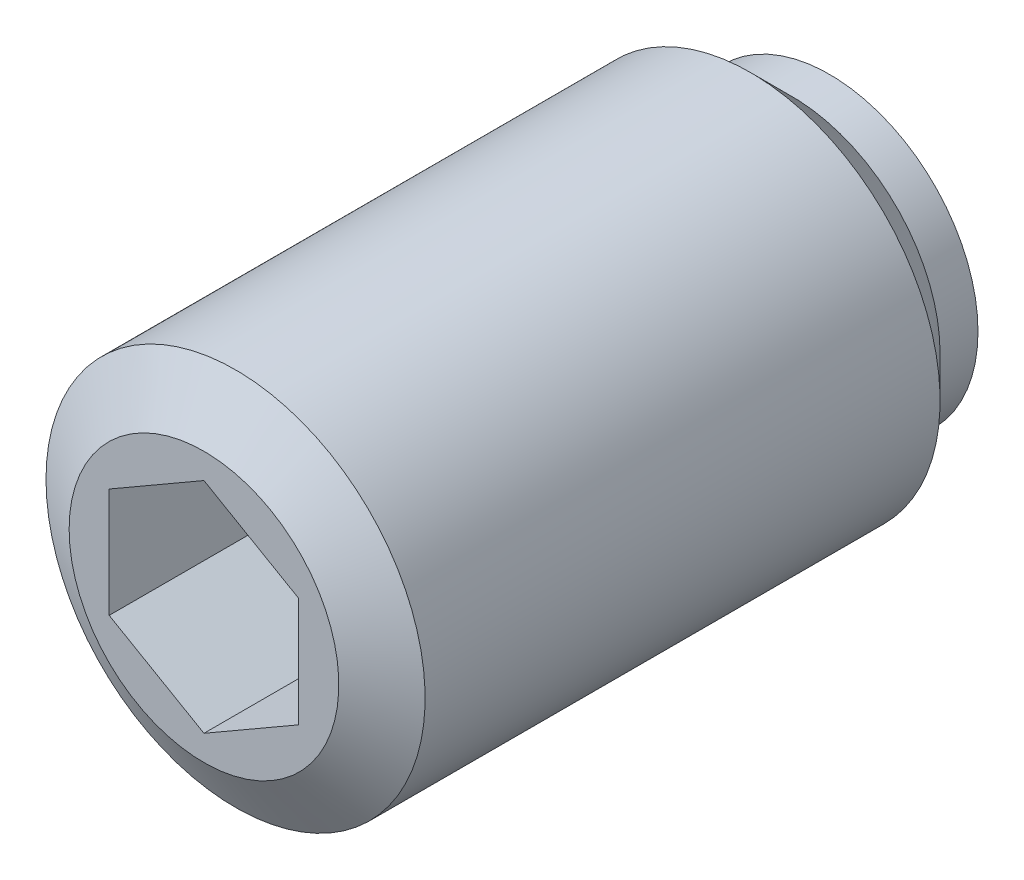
ISO-10303-21;
HEADER;
FILE_DESCRIPTION(('STEP AP214'),'2;1');
FILE_NAME('part.step','',(''),(''),'','','');
FILE_SCHEMA(('AUTOMOTIVE_DESIGN { 1 0 10303 214 1 1 1 1 }'));
ENDSEC;
DATA;
#1=APPLICATION_CONTEXT('core data for automotive mechanical design processes');
#2=APPLICATION_PROTOCOL_DEFINITION('international standard','automotive_design',2000,#1);
#3=PRODUCT_CONTEXT('',#1,'mechanical');
#4=PRODUCT('Part','Part','',(#3));
#5=PRODUCT_RELATED_PRODUCT_CATEGORY('part','',(#4));
#6=PRODUCT_DEFINITION_FORMATION('','',#4);
#7=PRODUCT_DEFINITION_CONTEXT('part definition',#1,'design');
#8=PRODUCT_DEFINITION('design','',#6,#7);
#9=PRODUCT_DEFINITION_SHAPE('','',#8);
#10=(LENGTH_UNIT() NAMED_UNIT(*) SI_UNIT(.MILLI.,.METRE.));
#11=(NAMED_UNIT(*) PLANE_ANGLE_UNIT() SI_UNIT($,.RADIAN.));
#12=(NAMED_UNIT(*) SI_UNIT($,.STERADIAN.) SOLID_ANGLE_UNIT());
#13=UNCERTAINTY_MEASURE_WITH_UNIT(LENGTH_MEASURE(1.E-05),#10,'distance_accuracy_value','');
#14=(GEOMETRIC_REPRESENTATION_CONTEXT(3) GLOBAL_UNCERTAINTY_ASSIGNED_CONTEXT((#13)) GLOBAL_UNIT_ASSIGNED_CONTEXT((#10,
#11,#12)) REPRESENTATION_CONTEXT('',''));
#15=CARTESIAN_POINT('',(0.,0.,0.));
#16=DIRECTION('',(0.,0.,1.));
#17=DIRECTION('',(1.,0.,0.));
#18=AXIS2_PLACEMENT_3D('',#15,#16,#17);
#19=CARTESIAN_POINT('',(0.,1.50253119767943,0.));
#20=DIRECTION('',(0.,0.,1.));
#21=DIRECTION('',(-1.,0.,0.));
#22=AXIS2_PLACEMENT_3D('',#19,#20,#21);
#23=PLANE('',#22);
#24=CARTESIAN_POINT('',(0.,0.,0.));
#25=DIRECTION('',(0.,0.,1.));
#26=DIRECTION('',(-1.,0.,0.));
#27=AXIS2_PLACEMENT_3D('',#24,#25,#26);
#28=CIRCLE('',#27,1.50253119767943);
#29=CARTESIAN_POINT('',(0.,1.50253119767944,0.));
#30=VERTEX_POINT('',#29);
#31=EDGE_CURVE('E9',#30,#30,#28,.T.);
#32=ORIENTED_EDGE('',*,*,#31,.F.);
#33=EDGE_LOOP('',(#32));
#34=FACE_BOUND('',#33,.T.);
#35=ADVANCED_FACE('F14',(#34),#23,.F.);
#36=CARTESIAN_POINT('',(0.,0.,1.32));
#37=DIRECTION('',(0.,0.,1.));
#38=DIRECTION('',(0.,1.,0.));
#39=AXIS2_PLACEMENT_3D('',#36,#37,#38);
#40=SPHERICAL_SURFACE('',#39,2.);
#41=CARTESIAN_POINT('',(0.,0.,0.4));
#42=DIRECTION('',(0.,0.,1.));
#43=DIRECTION('',(-1.,0.,0.));
#44=AXIS2_PLACEMENT_3D('',#41,#42,#43);
#45=CIRCLE('',#44,1.77583783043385);
#46=CARTESIAN_POINT('',(0.,1.77583783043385,0.4));
#47=VERTEX_POINT('',#46);
#48=EDGE_CURVE('E21',#47,#47,#45,.T.);
#49=CARTESIAN_POINT('',(0.,1.77583783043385,0.4));
#50=CARTESIAN_POINT('',(0.,1.77351077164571,0.395508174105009));
#51=CARTESIAN_POINT('',(0.,1.77116666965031,0.391025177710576));
#52=CARTESIAN_POINT('',(0.,1.76644451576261,0.382077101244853));
#53=CARTESIAN_POINT('',(0.,1.76406646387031,0.377612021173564));
#54=CARTESIAN_POINT('',(0.,1.75927654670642,0.368700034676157));
#55=CARTESIAN_POINT('',(0.,1.75686468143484,0.36425312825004));
#56=CARTESIAN_POINT('',(0.,1.75200727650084,0.355377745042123));
#57=CARTESIAN_POINT('',(0.,1.74956173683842,0.350949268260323));
#58=CARTESIAN_POINT('',(0.,1.74463712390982,0.342110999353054));
#59=CARTESIAN_POINT('',(0.,1.74215805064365,0.337701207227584));
#60=CARTESIAN_POINT('',(0.,1.73716651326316,0.328900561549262));
#61=CARTESIAN_POINT('',(0.,1.73465404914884,0.324509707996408));
#62=CARTESIAN_POINT('',(0.,1.72959587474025,0.315747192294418));
#63=CARTESIAN_POINT('',(0.,1.72705016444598,0.311375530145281));
#64=CARTESIAN_POINT('',(0.,1.72192564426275,0.302651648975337));
#65=CARTESIAN_POINT('',(0.,1.71934683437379,0.29829942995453));
#66=CARTESIAN_POINT('',(0.,1.71415626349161,0.289614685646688));
#67=CARTESIAN_POINT('',(0.,1.71154450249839,0.285282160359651));
#68=CARTESIAN_POINT('',(0.,1.7062881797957,0.276637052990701));
#69=CARTESIAN_POINT('',(0.,1.70364361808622,0.272324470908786));
#70=CARTESIAN_POINT('',(0.,1.69832184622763,0.263719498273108));
#71=CARTESIAN_POINT('',(0.,1.69564463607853,0.259427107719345));
#72=CARTESIAN_POINT('',(0.,1.69025772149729,0.250862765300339));
#73=CARTESIAN_POINT('',(0.,1.68754801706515,0.246590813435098));
#74=CARTESIAN_POINT('',(0.,1.68209626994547,0.238067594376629));
#75=CARTESIAN_POINT('',(0.,1.67935422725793,0.233816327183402));
#76=CARTESIAN_POINT('',(0.,1.67383796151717,0.225334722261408));
#77=CARTESIAN_POINT('',(0.,1.67106373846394,0.221104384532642));
#78=CARTESIAN_POINT('',(0.,1.66548327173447,0.212664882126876));
#79=CARTESIAN_POINT('',(0.,1.66267702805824,0.208455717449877));
#80=CARTESIAN_POINT('',(0.,1.65703268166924,0.200058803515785));
#81=CARTESIAN_POINT('',(0.,1.65419457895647,0.195871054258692));
#82=CARTESIAN_POINT('',(0.,1.64848667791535,0.18751721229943));
#83=CARTESIAN_POINT('',(0.,1.645616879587,0.18335111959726));
#84=CARTESIAN_POINT('',(0.,1.63984575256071,0.175040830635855));
#85=CARTESIAN_POINT('',(0.,1.63694442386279,0.170896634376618));
#86=CARTESIAN_POINT('',(0.,1.63111040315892,0.162630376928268));
#87=CARTESIAN_POINT('',(0.,1.62817771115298,0.158508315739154));
#88=CARTESIAN_POINT('',(0.,1.62228113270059,0.150286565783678));
#89=CARTESIAN_POINT('',(0.,1.61931724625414,0.146186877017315));
#90=CARTESIAN_POINT('',(0.,1.61335844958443,0.138010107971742));
#91=CARTESIAN_POINT('',(0.,1.61036353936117,0.133933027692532));
#92=CARTESIAN_POINT('',(0.,1.60434286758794,0.125801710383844));
#93=CARTESIAN_POINT('',(0.,1.60131710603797,0.121747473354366));
#94=CARTESIAN_POINT('',(0.,1.59523490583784,0.113662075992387));
#95=CARTESIAN_POINT('',(0.,1.59217846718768,0.109630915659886));
#96=CARTESIAN_POINT('',(0.,1.58603508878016,0.101591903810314));
#97=CARTESIAN_POINT('',(0.,1.58294814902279,0.0975840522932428));
#98=CARTESIAN_POINT('',(0.,1.57674394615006,0.0895918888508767));
#99=CARTESIAN_POINT('',(0.,1.57362668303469,0.0856075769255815));
#100=CARTESIAN_POINT('',(0.,1.56736201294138,0.0776627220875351));
#101=CARTESIAN_POINT('',(0.,1.56421460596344,0.0737021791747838));
#102=CARTESIAN_POINT('',(0.,1.5578898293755,0.0658050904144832));
#103=CARTESIAN_POINT('',(0.,1.55471245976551,0.0618685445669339));
#104=CARTESIAN_POINT('',(0.,1.54832794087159,0.0540196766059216));
#105=CARTESIAN_POINT('',(0.,1.54512079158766,0.0501073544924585));
#106=CARTESIAN_POINT('',(0.,1.53867689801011,0.0423071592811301));
#107=CARTESIAN_POINT('',(0.,1.53544015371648,0.0384192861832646));
#108=CARTESIAN_POINT('',(0.,1.52893725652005,0.0306682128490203));
#109=CARTESIAN_POINT('',(0.,1.52567110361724,0.0268050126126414));
#110=CARTESIAN_POINT('',(0.,1.5191095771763,0.019103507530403));
#111=CARTESIAN_POINT('',(0.,1.51581420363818,0.0152652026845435));
#112=CARTESIAN_POINT('',(0.,1.50919442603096,0.00761370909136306));
#113=CARTESIAN_POINT('',(0.,1.50587002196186,0.00380052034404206));
#114=CARTESIAN_POINT('',(0.,1.50253119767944,0.));
#115=B_SPLINE_CURVE_WITH_KNOTS('',3,(#49,#50,#51,#52,#53,#54,#55,#56,#57,#58,#59,#60,#61,#62,
#63,#64,#65,#66,#67,#68,#69,#70,#71,#72,#73,#74,#75,#76,#77,#78,#79,#80,#81,#82,#83,#84,#85,#86,
#87,#88,#89,#90,#91,#92,#93,#94,#95,#96,#97,#98,#99,#100,#101,#102,#103,#104,#105,#106,#107,
#108,#109,#110,#111,#112,#113,#114),.UNSPECIFIED.,.F.,.F.,(4,2,2,2,2,2,2,2,2,2,2,2,2,2,2,2,2,2,
2,2,2,2,2,2,2,2,2,2,2,2,2,2,4),(0.,0.0151764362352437,0.0303528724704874,0.0455293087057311,
0.0607057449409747,0.0758821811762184,0.0910586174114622,0.106235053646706,0.121411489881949,
0.136587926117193,0.151764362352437,0.16694079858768,0.182117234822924,0.197293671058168,
0.212470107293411,0.227646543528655,0.242822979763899,0.257999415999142,0.273175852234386,
0.28835228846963,0.303528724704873,0.318705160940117,0.33388159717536,0.349058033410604,
0.364234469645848,0.379410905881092,0.394587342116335,0.409763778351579,0.424940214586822,
0.440116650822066,0.45529308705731,0.470469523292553,0.485645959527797),.UNSPECIFIED.);
#116=EDGE_CURVE('BSEAM141',#47,#30,#115,.T.);
#117=ORIENTED_EDGE('',*,*,#48,.F.);
#118=ORIENTED_EDGE('',*,*,#31,.T.);
#119=ORIENTED_EDGE('',*,*,#116,.T.);
#120=ORIENTED_EDGE('',*,*,#116,.F.);
#121=EDGE_LOOP('',(#117,#119,#118,#120));
#122=FACE_BOUND('',#121,.T.);
#123=ADVANCED_FACE('F141',(#122),#40,.T.);
#124=CARTESIAN_POINT('',(0.,2.35,0.4));
#125=DIRECTION('',(0.,0.,1.));
#126=DIRECTION('',(-1.,0.,0.));
#127=AXIS2_PLACEMENT_3D('',#124,#125,#126);
#128=PLANE('',#127);
#129=CARTESIAN_POINT('',(0.,0.,0.4));
#130=DIRECTION('',(0.,0.,1.));
#131=DIRECTION('',(-1.,0.,0.));
#132=AXIS2_PLACEMENT_3D('',#129,#130,#131);
#133=CIRCLE('',#132,2.35);
#134=CARTESIAN_POINT('',(-2.35,0.,0.4));
#135=VERTEX_POINT('',#134);
#136=EDGE_CURVE('E134',#135,#135,#133,.T.);
#137=ORIENTED_EDGE('',*,*,#136,.F.);
#138=EDGE_LOOP('',(#137));
#139=FACE_BOUND('',#138,.T.);
#140=ORIENTED_EDGE('',*,*,#48,.T.);
#141=EDGE_LOOP('',(#140));
#142=FACE_BOUND('',#141,.T.);
#143=ADVANCED_FACE('F139',(#139,#142),#128,.F.);
#144=CARTESIAN_POINT('',(0.,0.,11.6950749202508));
#145=DIRECTION('',(0.,0.,1.));
#146=DIRECTION('',(-1.,0.,0.));
#147=AXIS2_PLACEMENT_3D('',#144,#145,#146);
#148=CYLINDRICAL_SURFACE('',#147,2.35);
#149=CARTESIAN_POINT('',(0.,0.,1.));
#150=DIRECTION('',(0.,0.,1.));
#151=DIRECTION('',(-1.,0.,0.));
#152=AXIS2_PLACEMENT_3D('',#149,#150,#151);
#153=CIRCLE('',#152,2.35);
#154=CARTESIAN_POINT('',(-2.35,0.,1.));
#155=VERTEX_POINT('',#154);
#156=EDGE_CURVE('E131',#155,#155,#153,.T.);
#157=ORIENTED_EDGE('',*,*,#156,.F.);
#158=EDGE_LOOP('',(#157));
#159=FACE_BOUND('',#158,.T.);
#160=ORIENTED_EDGE('',*,*,#136,.T.);
#161=EDGE_LOOP('',(#160));
#162=FACE_BOUND('',#161,.T.);
#163=ADVANCED_FACE('F164',(#159,#162),#148,.T.);
#164=CARTESIAN_POINT('',(0.,0.,1.));
#165=DIRECTION('',(0.,0.,1.));
#166=DIRECTION('',(-1.,0.,0.));
#167=AXIS2_PLACEMENT_3D('',#164,#165,#166);
#168=CONICAL_SURFACE('',#167,2.35,0.78539816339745);
#169=CARTESIAN_POINT('',(0.,0.,1.65));
#170=DIRECTION('',(0.,0.,1.));
#171=DIRECTION('',(-1.,0.,0.));
#172=AXIS2_PLACEMENT_3D('',#169,#170,#171);
#173=CIRCLE('',#172,3.);
#174=CARTESIAN_POINT('',(-3.,0.,1.65));
#175=VERTEX_POINT('',#174);
#176=EDGE_CURVE('E128',#175,#175,#173,.T.);
#177=ORIENTED_EDGE('',*,*,#176,.F.);
#178=EDGE_LOOP('',(#177));
#179=FACE_BOUND('',#178,.T.);
#180=ORIENTED_EDGE('',*,*,#156,.T.);
#181=EDGE_LOOP('',(#180));
#182=FACE_BOUND('',#181,.T.);
#183=ADVANCED_FACE('F173',(#179,#182),#168,.T.);
#184=CARTESIAN_POINT('',(0.,0.,11.6950749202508));
#185=DIRECTION('',(0.,0.,1.));
#186=DIRECTION('',(-1.,0.,0.));
#187=AXIS2_PLACEMENT_3D('',#184,#185,#186);
#188=CYLINDRICAL_SURFACE('',#187,3.);
#189=CARTESIAN_POINT('',(0.,0.,9.8));
#190=DIRECTION('',(0.,0.,1.));
#191=DIRECTION('',(-1.,0.,0.));
#192=AXIS2_PLACEMENT_3D('',#189,#190,#191);
#193=CIRCLE('',#192,3.);
#194=CARTESIAN_POINT('',(-3.,0.,9.8));
#195=VERTEX_POINT('',#194);
#196=EDGE_CURVE('E125',#195,#195,#193,.T.);
#197=ORIENTED_EDGE('',*,*,#196,.F.);
#198=EDGE_LOOP('',(#197));
#199=FACE_BOUND('',#198,.T.);
#200=ORIENTED_EDGE('',*,*,#176,.T.);
#201=EDGE_LOOP('',(#200));
#202=FACE_BOUND('',#201,.T.);
#203=ADVANCED_FACE('F182',(#199,#202),#188,.T.);
#204=CARTESIAN_POINT('',(0.,0.,9.8));
#205=DIRECTION('',(0.,0.,-1.));
#206=DIRECTION('',(1.,0.,0.));
#207=AXIS2_PLACEMENT_3D('',#204,#205,#206);
#208=CONICAL_SURFACE('',#207,3.,1.04719755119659);
#209=CARTESIAN_POINT('',(0.,0.,10.3));
#210=DIRECTION('',(0.,0.,1.));
#211=DIRECTION('',(-1.,0.,0.));
#212=AXIS2_PLACEMENT_3D('',#209,#210,#211);
#213=CIRCLE('',#212,2.13397459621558);
#214=CARTESIAN_POINT('',(-2.13397459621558,0.,10.3));
#215=VERTEX_POINT('',#214);
#216=EDGE_CURVE('E116',#215,#215,#213,.T.);
#217=ORIENTED_EDGE('',*,*,#216,.F.);
#218=EDGE_LOOP('',(#217));
#219=FACE_BOUND('',#218,.T.);
#220=ORIENTED_EDGE('',*,*,#196,.T.);
#221=EDGE_LOOP('',(#220));
#222=FACE_BOUND('',#221,.T.);
#223=ADVANCED_FACE('F191',(#219,#222),#208,.T.);
#224=CARTESIAN_POINT('',(0.,0.,10.3));
#225=DIRECTION('',(0.,0.,-1.));
#226=DIRECTION('',(1.,0.,0.));
#227=AXIS2_PLACEMENT_3D('',#224,#225,#226);
#228=PLANE('',#227);
#229=DIRECTION('',(-0.866025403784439,-0.5,0.));
#230=VECTOR('',#229,1.);
#231=CARTESIAN_POINT('',(0.,1.73205080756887,10.3));
#232=LINE('',#231,#230);
#233=CARTESIAN_POINT('',(0.,1.73205080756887,10.3));
#234=VERTEX_POINT('',#233);
#235=CARTESIAN_POINT('',(-1.5,0.866025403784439,10.3));
#236=VERTEX_POINT('',#235);
#237=EDGE_CURVE('E82',#234,#236,#232,.T.);
#238=ORIENTED_EDGE('',*,*,#237,.F.);
#239=DIRECTION('',(-0.866025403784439,0.5,0.));
#240=VECTOR('',#239,1.);
#241=CARTESIAN_POINT('',(1.5,0.866025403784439,10.3));
#242=LINE('',#241,#240);
#243=CARTESIAN_POINT('',(1.5,0.866025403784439,10.3));
#244=VERTEX_POINT('',#243);
#245=EDGE_CURVE('E28',#244,#234,#242,.T.);
#246=ORIENTED_EDGE('',*,*,#245,.F.);
#247=DIRECTION('',(0.,1.,0.));
#248=VECTOR('',#247,1.);
#249=CARTESIAN_POINT('',(1.5,-0.866025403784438,10.3));
#250=LINE('',#249,#248);
#251=CARTESIAN_POINT('',(1.5,-0.866025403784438,10.3));
#252=VERTEX_POINT('',#251);
#253=EDGE_CURVE('E98',#252,#244,#250,.T.);
#254=ORIENTED_EDGE('',*,*,#253,.F.);
#255=DIRECTION('',(0.866025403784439,0.5,0.));
#256=VECTOR('',#255,1.);
#257=CARTESIAN_POINT('',(0.,-1.73205080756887,10.3));
#258=LINE('',#257,#256);
#259=CARTESIAN_POINT('',(0.,-1.73205080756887,10.3));
#260=VERTEX_POINT('',#259);
#261=EDGE_CURVE('E92',#260,#252,#258,.T.);
#262=ORIENTED_EDGE('',*,*,#261,.F.);
#263=DIRECTION('',(0.866025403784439,-0.5,0.));
#264=VECTOR('',#263,1.);
#265=CARTESIAN_POINT('',(-1.5,-0.866025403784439,10.3));
#266=LINE('',#265,#264);
#267=CARTESIAN_POINT('',(-1.5,-0.866025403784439,10.3));
#268=VERTEX_POINT('',#267);
#269=EDGE_CURVE('E90',#268,#260,#266,.T.);
#270=ORIENTED_EDGE('',*,*,#269,.F.);
#271=DIRECTION('',(0.,-1.,0.));
#272=VECTOR('',#271,1.);
#273=CARTESIAN_POINT('',(-1.5,0.866025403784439,10.3));
#274=LINE('',#273,#272);
#275=EDGE_CURVE('E71',#236,#268,#274,.T.);
#276=ORIENTED_EDGE('',*,*,#275,.F.);
#277=EDGE_LOOP('',(#238,#246,#254,#262,#270,#276));
#278=FACE_BOUND('',#277,.T.);
#279=ORIENTED_EDGE('',*,*,#216,.T.);
#280=EDGE_LOOP('',(#279));
#281=FACE_BOUND('',#280,.T.);
#282=ADVANCED_FACE('F86',(#278,#281),#228,.F.);
#283=CARTESIAN_POINT('',(1.5,0.866025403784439,7.3));
#284=DIRECTION('',(0.5,0.866025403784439,0.));
#285=DIRECTION('',(0.866025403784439,-0.5,0.));
#286=AXIS2_PLACEMENT_3D('',#283,#284,#285);
#287=PLANE('',#286);
#288=ORIENTED_EDGE('',*,*,#245,.T.);
#289=DIRECTION('',(0.,0.,1.));
#290=VECTOR('',#289,1.);
#291=CARTESIAN_POINT('',(0.,1.73205080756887,7.3));
#292=LINE('',#291,#290);
#293=CARTESIAN_POINT('',(0.,1.73205080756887,7.3));
#294=VERTEX_POINT('',#293);
#295=EDGE_CURVE('E79',#294,#234,#292,.T.);
#296=ORIENTED_EDGE('',*,*,#295,.F.);
#297=DIRECTION('',(-0.866025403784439,0.5,0.));
#298=VECTOR('',#297,1.);
#299=CARTESIAN_POINT('',(1.5,0.866025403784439,7.3));
#300=LINE('',#299,#298);
#301=CARTESIAN_POINT('',(1.5,0.866025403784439,7.3));
#302=VERTEX_POINT('',#301);
#303=EDGE_CURVE('E100',#302,#294,#300,.T.);
#304=ORIENTED_EDGE('',*,*,#303,.F.);
#305=DIRECTION('',(0.,0.,1.));
#306=VECTOR('',#305,1.);
#307=CARTESIAN_POINT('',(1.5,0.866025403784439,7.3));
#308=LINE('',#307,#306);
#309=EDGE_CURVE('E35',#302,#244,#308,.T.);
#310=ORIENTED_EDGE('',*,*,#309,.T.);
#311=EDGE_LOOP('',(#288,#296,#304,#310));
#312=FACE_BOUND('',#311,.T.);
#313=ADVANCED_FACE('F208',(#312),#287,.F.);
#314=CARTESIAN_POINT('',(1.5,-0.866025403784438,7.3));
#315=DIRECTION('',(1.,0.,0.));
#316=DIRECTION('',(0.,-1.,0.));
#317=AXIS2_PLACEMENT_3D('',#314,#315,#316);
#318=PLANE('',#317);
#319=ORIENTED_EDGE('',*,*,#253,.T.);
#320=ORIENTED_EDGE('',*,*,#309,.F.);
#321=DIRECTION('',(0.,1.,0.));
#322=VECTOR('',#321,1.);
#323=CARTESIAN_POINT('',(1.5,-0.866025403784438,7.3));
#324=LINE('',#323,#322);
#325=CARTESIAN_POINT('',(1.5,-0.866025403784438,7.3));
#326=VERTEX_POINT('',#325);
#327=EDGE_CURVE('E112',#326,#302,#324,.T.);
#328=ORIENTED_EDGE('',*,*,#327,.F.);
#329=DIRECTION('',(0.,0.,1.));
#330=VECTOR('',#329,1.);
#331=CARTESIAN_POINT('',(1.5,-0.866025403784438,7.3));
#332=LINE('',#331,#330);
#333=EDGE_CURVE('E117',#326,#252,#332,.T.);
#334=ORIENTED_EDGE('',*,*,#333,.T.);
#335=EDGE_LOOP('',(#319,#320,#328,#334));
#336=FACE_BOUND('',#335,.T.);
#337=ADVANCED_FACE('F216',(#336),#318,.F.);
#338=CARTESIAN_POINT('',(0.,-1.73205080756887,7.3));
#339=DIRECTION('',(0.5,-0.866025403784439,0.));
#340=DIRECTION('',(-0.866025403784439,-0.5,0.));
#341=AXIS2_PLACEMENT_3D('',#338,#339,#340);
#342=PLANE('',#341);
#343=ORIENTED_EDGE('',*,*,#261,.T.);
#344=ORIENTED_EDGE('',*,*,#333,.F.);
#345=DIRECTION('',(0.866025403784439,0.5,0.));
#346=VECTOR('',#345,1.);
#347=CARTESIAN_POINT('',(0.,-1.73205080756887,7.3));
#348=LINE('',#347,#346);
#349=CARTESIAN_POINT('',(0.,-1.73205080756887,7.3));
#350=VERTEX_POINT('',#349);
#351=EDGE_CURVE('E109',#350,#326,#348,.T.);
#352=ORIENTED_EDGE('',*,*,#351,.F.);
#353=DIRECTION('',(0.,0.,1.));
#354=VECTOR('',#353,1.);
#355=CARTESIAN_POINT('',(0.,-1.73205080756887,7.3));
#356=LINE('',#355,#354);
#357=EDGE_CURVE('E119',#350,#260,#356,.T.);
#358=ORIENTED_EDGE('',*,*,#357,.T.);
#359=EDGE_LOOP('',(#343,#344,#352,#358));
#360=FACE_BOUND('',#359,.T.);
#361=ADVANCED_FACE('F224',(#360),#342,.F.);
#362=CARTESIAN_POINT('',(-1.5,-0.866025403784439,7.3));
#363=DIRECTION('',(-0.5,-0.866025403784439,0.));
#364=DIRECTION('',(-0.866025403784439,0.5,0.));
#365=AXIS2_PLACEMENT_3D('',#362,#363,#364);
#366=PLANE('',#365);
#367=ORIENTED_EDGE('',*,*,#269,.T.);
#368=ORIENTED_EDGE('',*,*,#357,.F.);
#369=DIRECTION('',(0.866025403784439,-0.5,0.));
#370=VECTOR('',#369,1.);
#371=CARTESIAN_POINT('',(-1.5,-0.866025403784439,7.3));
#372=LINE('',#371,#370);
#373=CARTESIAN_POINT('',(-1.5,-0.866025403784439,7.3));
#374=VERTEX_POINT('',#373);
#375=EDGE_CURVE('E106',#374,#350,#372,.T.);
#376=ORIENTED_EDGE('',*,*,#375,.F.);
#377=DIRECTION('',(0.,0.,1.));
#378=VECTOR('',#377,1.);
#379=CARTESIAN_POINT('',(-1.5,-0.866025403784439,7.3));
#380=LINE('',#379,#378);
#381=EDGE_CURVE('E78',#374,#268,#380,.T.);
#382=ORIENTED_EDGE('',*,*,#381,.T.);
#383=EDGE_LOOP('',(#367,#368,#376,#382));
#384=FACE_BOUND('',#383,.T.);
#385=ADVANCED_FACE('F232',(#384),#366,.F.);
#386=CARTESIAN_POINT('',(-1.5,0.866025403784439,7.3));
#387=DIRECTION('',(-1.,0.,0.));
#388=DIRECTION('',(0.,1.,0.));
#389=AXIS2_PLACEMENT_3D('',#386,#387,#388);
#390=PLANE('',#389);
#391=ORIENTED_EDGE('',*,*,#275,.T.);
#392=ORIENTED_EDGE('',*,*,#381,.F.);
#393=DIRECTION('',(0.,-1.,0.));
#394=VECTOR('',#393,1.);
#395=CARTESIAN_POINT('',(-1.5,0.866025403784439,7.3));
#396=LINE('',#395,#394);
#397=CARTESIAN_POINT('',(-1.5,0.866025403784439,7.3));
#398=VERTEX_POINT('',#397);
#399=EDGE_CURVE('E74',#398,#374,#396,.T.);
#400=ORIENTED_EDGE('',*,*,#399,.F.);
#401=DIRECTION('',(0.,0.,1.));
#402=VECTOR('',#401,1.);
#403=CARTESIAN_POINT('',(-1.5,0.866025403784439,7.3));
#404=LINE('',#403,#402);
#405=EDGE_CURVE('E67',#398,#236,#404,.T.);
#406=ORIENTED_EDGE('',*,*,#405,.T.);
#407=EDGE_LOOP('',(#391,#392,#400,#406));
#408=FACE_BOUND('',#407,.T.);
#409=ADVANCED_FACE('F69',(#408),#390,.F.);
#410=CARTESIAN_POINT('',(0.,1.73205080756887,7.3));
#411=DIRECTION('',(-0.5,0.866025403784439,0.));
#412=DIRECTION('',(0.866025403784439,0.5,0.));
#413=AXIS2_PLACEMENT_3D('',#410,#411,#412);
#414=PLANE('',#413);
#415=ORIENTED_EDGE('',*,*,#237,.T.);
#416=ORIENTED_EDGE('',*,*,#405,.F.);
#417=DIRECTION('',(-0.866025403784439,-0.5,0.));
#418=VECTOR('',#417,1.);
#419=CARTESIAN_POINT('',(0.,1.73205080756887,7.3));
#420=LINE('',#419,#418);
#421=EDGE_CURVE('E103',#294,#398,#420,.T.);
#422=ORIENTED_EDGE('',*,*,#421,.F.);
#423=ORIENTED_EDGE('',*,*,#295,.T.);
#424=EDGE_LOOP('',(#415,#416,#422,#423));
#425=FACE_BOUND('',#424,.T.);
#426=ADVANCED_FACE('F83',(#425),#414,.F.);
#427=CARTESIAN_POINT('',(3.,0.,7.3));
#428=DIRECTION('',(0.,0.,-1.));
#429=DIRECTION('',(1.,0.,0.));
#430=AXIS2_PLACEMENT_3D('',#427,#428,#429);
#431=PLANE('',#430);
#432=ORIENTED_EDGE('',*,*,#303,.T.);
#433=ORIENTED_EDGE('',*,*,#421,.T.);
#434=ORIENTED_EDGE('',*,*,#399,.T.);
#435=ORIENTED_EDGE('',*,*,#375,.T.);
#436=ORIENTED_EDGE('',*,*,#351,.T.);
#437=ORIENTED_EDGE('',*,*,#327,.T.);
#438=EDGE_LOOP('',(#432,#433,#434,#435,#436,#437));
#439=FACE_BOUND('',#438,.T.);
#440=ADVANCED_FACE('F256',(#439),#431,.F.);
#441=CLOSED_SHELL('',(#35,#123,#143,#163,#183,#203,#223,#282,#313,#337,#361,#385,#409,#426,#440));
#442=MANIFOLD_SOLID_BREP('B1',#441);
#443=ADVANCED_BREP_SHAPE_REPRESENTATION('',(#18,#442),#14);
#444=SHAPE_DEFINITION_REPRESENTATION(#9,#443);
ENDSEC;
END-ISO-10303-21;
